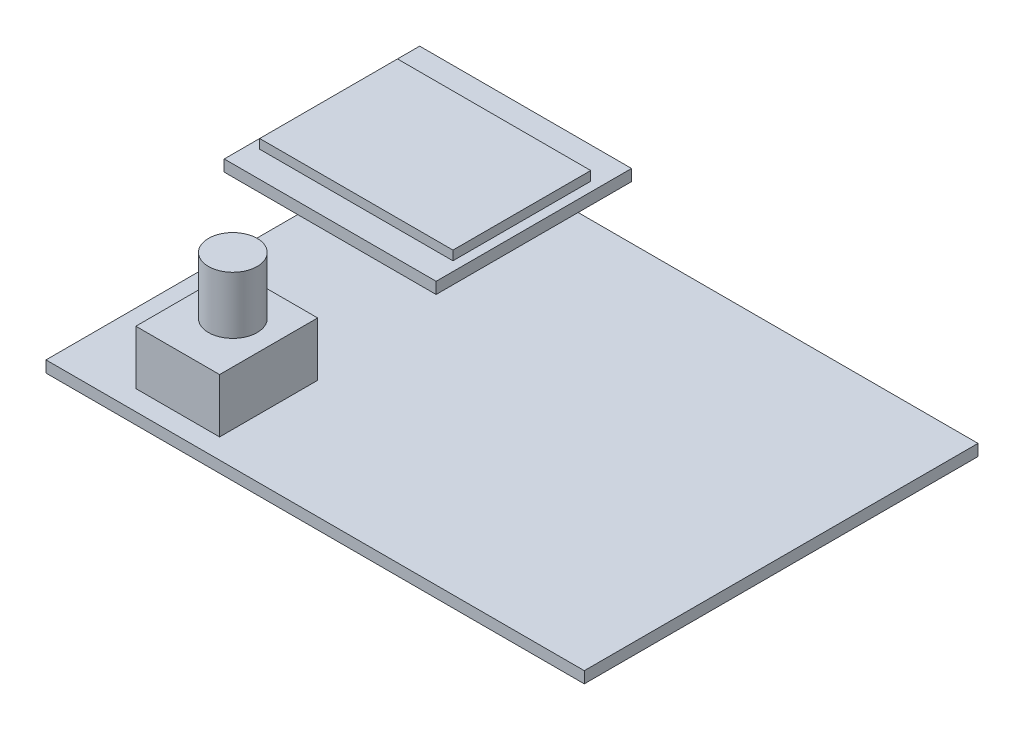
from build123d import *

# Parameters (mm, degrees)
SKETCH2_W           = 55
SKETCH2_H           = 1.6
BOSS_EXTRUDE1_DEPTH = 75.2
SKETCH4_W           = 29.6
SKETCH4_H           = 27.3
BOSS_EXTRUDE2_DEPTH = 1.6
SKETCH5_W           = 27
SKETCH5_H           = 19.25
BOSS_EXTRUDE3_DEPTH = 1.3
SKETCH6_W           = 11.7
SKETCH6_H           = 13.7
BOSS_EXTRUDE4_DEPTH = 7.55
SKETCH7_R           = 3.4
BOSS_EXTRUDE5_DEPTH = 8


with BuildPart() as part:
    # Sketch2 → Boss-Extrude1 (new body)
    with BuildSketch(Plane.ZY.offset(45.85)):
        with Locations((-0.05, 39)):
            Rectangle(SKETCH2_W, SKETCH2_H)
    extrude(amount=-BOSS_EXTRUDE1_DEPTH)

    # Sketch6 → Boss-Extrude4 (add)
    with BuildSketch(Plane(origin=(0, 39.8, 0), x_dir=(1, 0, 0), z_dir=(0, 1, 0))):
        with Locations((-30.25, -17.8)):
            Rectangle(SKETCH6_W, SKETCH6_H)
    extrude(amount=BOSS_EXTRUDE4_DEPTH)

    # Sketch7 → Boss-Extrude5 (add)
    with BuildSketch(Plane(origin=(0, 47.35, 0), x_dir=(1, 0, 0), z_dir=(0, 1, 0))):
        with Locations(Location((-30.25, -16.95, 0), (0, 0, 270))):
            Circle(SKETCH7_R)
    extrude(amount=BOSS_EXTRUDE5_DEPTH)


with BuildPart() as body_2:
    # Sketch4 → Boss-Extrude2 (new body)
    with BuildSketch(Plane(origin=(0, 52.06, 0), x_dir=(1, 0, 0), z_dir=(0, 1, 0))):
        with Locations((-29.05, 9.1)):
            Rectangle(SKETCH4_W, SKETCH4_H)
    extrude(amount=BOSS_EXTRUDE2_DEPTH)

    # Sketch5 → Boss-Extrude3 (add)
    with BuildSketch(Plane(origin=(0, 53.66, 0), x_dir=(1, 0, 0), z_dir=(0, 1, 0))):
        with Locations((-29.05, 8.725)):
            Rectangle(SKETCH5_W, SKETCH5_H)
    extrude(amount=BOSS_EXTRUDE3_DEPTH)


solid = Compound([part.part, body_2.part])
